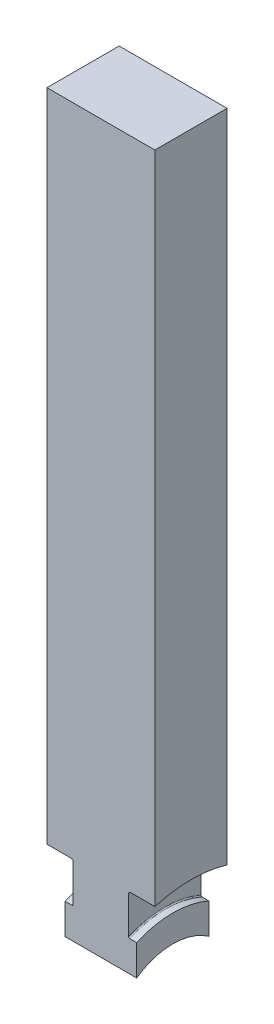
from build123d import *

# Parameters (mm, degrees)
SKETCH1_W               = 25.654
SKETCH1_H               = 276.225
BOSS_EXTRUDE1_DEPTH     = 19.177
CUT_EXTRUDE4_DEPTH      = 278.186832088
CUT_EXTRUDE4_DEPTH_BACK = 278.186832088
SKETCH8_R               = 22.225
SKETCH2_W               = 9.3218
SKETCH2_H               = 13.4874
CUT_EXTRUDE3_DEPTH      = 278.186832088
CUT_EXTRUDE3_DEPTH_BACK = 278.186832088
SKETCH7_W               = 6.477
SKETCH7_H               = 31.75
FILLET1_R               = 0.762
FILLET2_R               = 0.381


with BuildPart() as part:
    # Sketch1 → Boss-Extrude1 (new, symmetric)
    with BuildSketch(Plane(origin=(0, 0, 0), x_dir=(0, 0, -1), z_dir=(1, 0, 0))):
        with Locations((0, 138.1125)):
            Rectangle(SKETCH1_W, SKETCH1_H)
    extrude(amount=BOSS_EXTRUDE1_DEPTH, both=True)

    # Sketch8 → Cut-Extrude4 (cut, two sides: drawn at the far end of the back side and taken through both)
    with BuildSketch(Plane(origin=(0, 0, 0), x_dir=(0, 0, -1), z_dir=(1, 0, 0)).offset(-CUT_EXTRUDE4_DEPTH_BACK)):
        Circle(SKETCH8_R)
    extrude(amount=CUT_EXTRUDE4_DEPTH + CUT_EXTRUDE4_DEPTH_BACK, mode=Mode.SUBTRACT)

    # Sketch2 → Cut-Revolve1 (revolve, cut)
    with BuildSketch(Plane.XY):
        with Locations((14.5161, 38.4937)):
            Rectangle(SKETCH2_W, SKETCH2_H)
        with Locations((-14.5161, 38.4937)):
            Rectangle(SKETCH2_W, SKETCH2_H)
    revolve(axis=Axis((-8.84822894, 0, 0), (1, 0, 0)), mode=Mode.SUBTRACT)

    # Sketch7 → Cut-Extrude3 (cut, two sides: drawn at the far end of the back side and taken through both)
    with BuildSketch(Plane.XY.offset(-CUT_EXTRUDE3_DEPTH_BACK)):
        with Locations((-15.9385, 15.875)):
            Rectangle(SKETCH7_W, SKETCH7_H)
        with Locations((15.9385, 15.875)):
            Rectangle(SKETCH7_W, SKETCH7_H)
    extrude(amount=CUT_EXTRUDE3_DEPTH + CUT_EXTRUDE3_DEPTH_BACK, mode=Mode.SUBTRACT)

    # Fillet1
    fillet1_edges = [part.edges().sort_by_distance(p)[0] for p in [
        (9.8552, 45.2374, 0),
        (-9.8552, 45.2374, 0),
    ]]
    fillet(fillet1_edges, radius=FILLET1_R)

    # Fillet2
    fillet2_edges = [part.edges().sort_by_distance(p)[0] for p in [
        (9.8552, 31.75, 0),
        (-9.8552, 31.75, 0),
    ]]
    fillet(fillet2_edges, radius=FILLET2_R)


solid = part.part
